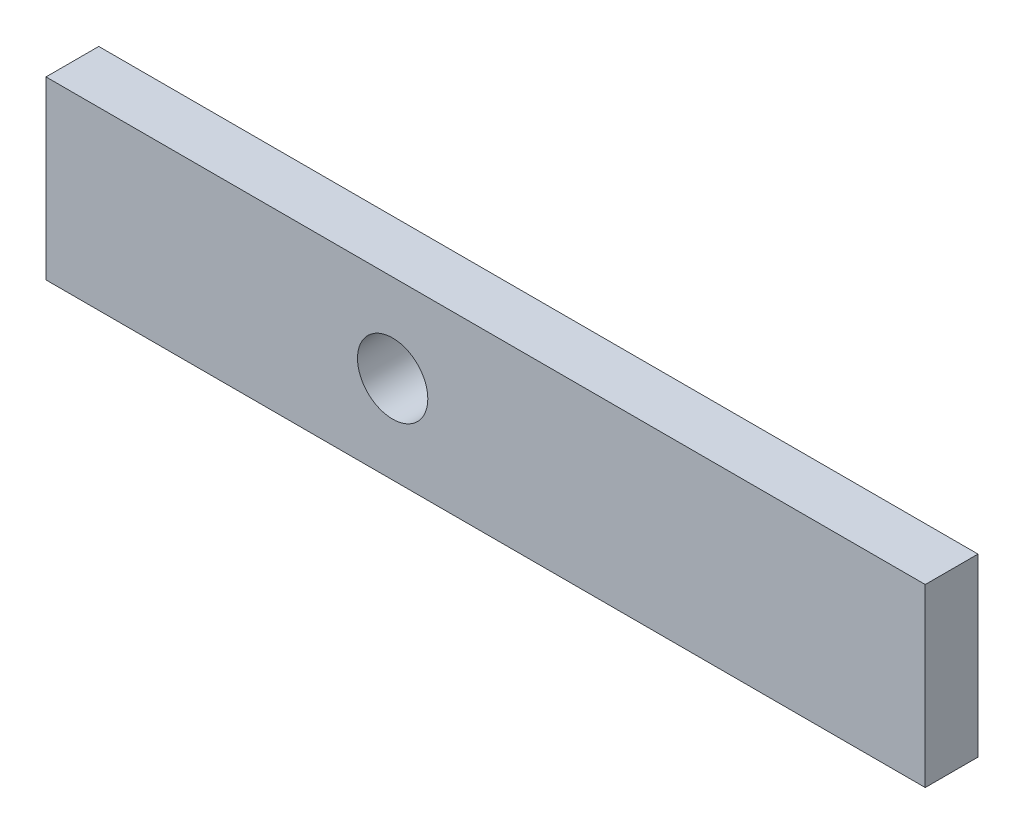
ISO-10303-21;
HEADER;
FILE_DESCRIPTION(('STEP AP214'),'2;1');
FILE_NAME('part.step','',(''),(''),'','','');
FILE_SCHEMA(('AUTOMOTIVE_DESIGN { 1 0 10303 214 1 1 1 1 }'));
ENDSEC;
DATA;
#1=APPLICATION_CONTEXT('core data for automotive mechanical design processes');
#2=APPLICATION_PROTOCOL_DEFINITION('international standard','automotive_design',2000,#1);
#3=PRODUCT_CONTEXT('',#1,'mechanical');
#4=PRODUCT('Part','Part','',(#3));
#5=PRODUCT_RELATED_PRODUCT_CATEGORY('part','',(#4));
#6=PRODUCT_DEFINITION_FORMATION('','',#4);
#7=PRODUCT_DEFINITION_CONTEXT('part definition',#1,'design');
#8=PRODUCT_DEFINITION('design','',#6,#7);
#9=PRODUCT_DEFINITION_SHAPE('','',#8);
#10=(LENGTH_UNIT() NAMED_UNIT(*) SI_UNIT(.MILLI.,.METRE.));
#11=(NAMED_UNIT(*) PLANE_ANGLE_UNIT() SI_UNIT($,.RADIAN.));
#12=(NAMED_UNIT(*) SI_UNIT($,.STERADIAN.) SOLID_ANGLE_UNIT());
#13=UNCERTAINTY_MEASURE_WITH_UNIT(LENGTH_MEASURE(1.E-05),#10,'distance_accuracy_value','');
#14=(GEOMETRIC_REPRESENTATION_CONTEXT(3) GLOBAL_UNCERTAINTY_ASSIGNED_CONTEXT((#13)) GLOBAL_UNIT_ASSIGNED_CONTEXT((#10,
#11,#12)) REPRESENTATION_CONTEXT('',''));
#15=CARTESIAN_POINT('',(0.,0.,0.));
#16=DIRECTION('',(0.,0.,1.));
#17=DIRECTION('',(1.,0.,0.));
#18=AXIS2_PLACEMENT_3D('',#15,#16,#17);
#19=CARTESIAN_POINT('',(0.,0.,6.));
#20=DIRECTION('',(1.,0.,0.));
#21=DIRECTION('',(0.,0.,-1.));
#22=AXIS2_PLACEMENT_3D('',#19,#20,#21);
#23=PLANE('',#22);
#24=DIRECTION('',(0.,-1.,0.));
#25=VECTOR('',#24,1.);
#26=CARTESIAN_POINT('',(0.,0.,0.));
#27=LINE('',#26,#25);
#28=CARTESIAN_POINT('',(0.,20.,0.));
#29=VERTEX_POINT('',#28);
#30=CARTESIAN_POINT('',(0.,0.,0.));
#31=VERTEX_POINT('',#30);
#32=EDGE_CURVE('E75',#29,#31,#27,.T.);
#33=ORIENTED_EDGE('',*,*,#32,.T.);
#34=DIRECTION('',(0.,0.,-1.));
#35=VECTOR('',#34,1.);
#36=CARTESIAN_POINT('',(0.,0.,6.));
#37=LINE('',#36,#35);
#38=CARTESIAN_POINT('',(0.,0.,6.));
#39=VERTEX_POINT('',#38);
#40=EDGE_CURVE('E11',#39,#31,#37,.T.);
#41=ORIENTED_EDGE('',*,*,#40,.F.);
#42=DIRECTION('',(0.,-1.,0.));
#43=VECTOR('',#42,1.);
#44=CARTESIAN_POINT('',(0.,0.,6.));
#45=LINE('',#44,#43);
#46=CARTESIAN_POINT('',(0.,20.,6.));
#47=VERTEX_POINT('',#46);
#48=EDGE_CURVE('E98',#47,#39,#45,.T.);
#49=ORIENTED_EDGE('',*,*,#48,.F.);
#50=DIRECTION('',(0.,0.,-1.));
#51=VECTOR('',#50,1.);
#52=CARTESIAN_POINT('',(0.,20.,6.));
#53=LINE('',#52,#51);
#54=EDGE_CURVE('E87',#47,#29,#53,.T.);
#55=ORIENTED_EDGE('',*,*,#54,.T.);
#56=EDGE_LOOP('',(#33,#41,#49,#55));
#57=FACE_BOUND('',#56,.T.);
#58=ADVANCED_FACE('F31',(#57),#23,.F.);
#59=CARTESIAN_POINT('',(0.,0.,6.));
#60=DIRECTION('',(0.,1.,0.));
#61=DIRECTION('',(0.,0.,1.));
#62=AXIS2_PLACEMENT_3D('',#59,#60,#61);
#63=PLANE('',#62);
#64=DIRECTION('',(1.,0.,0.));
#65=VECTOR('',#64,1.);
#66=CARTESIAN_POINT('',(0.,0.,0.));
#67=LINE('',#66,#65);
#68=CARTESIAN_POINT('',(100.,0.,0.));
#69=VERTEX_POINT('',#68);
#70=EDGE_CURVE('E71',#31,#69,#67,.T.);
#71=ORIENTED_EDGE('',*,*,#70,.T.);
#72=DIRECTION('',(0.,0.,-1.));
#73=VECTOR('',#72,1.);
#74=CARTESIAN_POINT('',(100.,0.,6.));
#75=LINE('',#74,#73);
#76=CARTESIAN_POINT('',(100.,0.,6.));
#77=VERTEX_POINT('',#76);
#78=EDGE_CURVE('E38',#77,#69,#75,.T.);
#79=ORIENTED_EDGE('',*,*,#78,.F.);
#80=DIRECTION('',(1.,0.,0.));
#81=VECTOR('',#80,1.);
#82=CARTESIAN_POINT('',(0.,0.,6.));
#83=LINE('',#82,#81);
#84=EDGE_CURVE('E83',#39,#77,#83,.T.);
#85=ORIENTED_EDGE('',*,*,#84,.F.);
#86=ORIENTED_EDGE('',*,*,#40,.T.);
#87=EDGE_LOOP('',(#71,#79,#85,#86));
#88=FACE_BOUND('',#87,.T.);
#89=ADVANCED_FACE('F82',(#88),#63,.F.);
#90=CARTESIAN_POINT('',(100.,0.,6.));
#91=DIRECTION('',(-1.,0.,0.));
#92=DIRECTION('',(0.,0.,1.));
#93=AXIS2_PLACEMENT_3D('',#90,#91,#92);
#94=PLANE('',#93);
#95=DIRECTION('',(0.,1.,0.));
#96=VECTOR('',#95,1.);
#97=CARTESIAN_POINT('',(100.,0.,0.));
#98=LINE('',#97,#96);
#99=CARTESIAN_POINT('',(100.,20.,0.));
#100=VERTEX_POINT('',#99);
#101=EDGE_CURVE('E76',#69,#100,#98,.T.);
#102=ORIENTED_EDGE('',*,*,#101,.T.);
#103=DIRECTION('',(0.,0.,-1.));
#104=VECTOR('',#103,1.);
#105=CARTESIAN_POINT('',(100.,20.,6.));
#106=LINE('',#105,#104);
#107=CARTESIAN_POINT('',(100.,20.,6.));
#108=VERTEX_POINT('',#107);
#109=EDGE_CURVE('E104',#108,#100,#106,.T.);
#110=ORIENTED_EDGE('',*,*,#109,.F.);
#111=DIRECTION('',(0.,1.,0.));
#112=VECTOR('',#111,1.);
#113=CARTESIAN_POINT('',(100.,0.,6.));
#114=LINE('',#113,#112);
#115=EDGE_CURVE('E50',#77,#108,#114,.T.);
#116=ORIENTED_EDGE('',*,*,#115,.F.);
#117=ORIENTED_EDGE('',*,*,#78,.T.);
#118=EDGE_LOOP('',(#102,#110,#116,#117));
#119=FACE_BOUND('',#118,.T.);
#120=ADVANCED_FACE('F107',(#119),#94,.F.);
#121=CARTESIAN_POINT('',(0.,20.,6.));
#122=DIRECTION('',(0.,-1.,0.));
#123=DIRECTION('',(0.,0.,-1.));
#124=AXIS2_PLACEMENT_3D('',#121,#122,#123);
#125=PLANE('',#124);
#126=DIRECTION('',(-1.,0.,0.));
#127=VECTOR('',#126,1.);
#128=CARTESIAN_POINT('',(0.,20.,0.));
#129=LINE('',#128,#127);
#130=EDGE_CURVE('E96',#100,#29,#129,.T.);
#131=ORIENTED_EDGE('',*,*,#130,.T.);
#132=ORIENTED_EDGE('',*,*,#54,.F.);
#133=DIRECTION('',(-1.,0.,0.));
#134=VECTOR('',#133,1.);
#135=CARTESIAN_POINT('',(0.,20.,6.));
#136=LINE('',#135,#134);
#137=EDGE_CURVE('E45',#108,#47,#136,.T.);
#138=ORIENTED_EDGE('',*,*,#137,.F.);
#139=ORIENTED_EDGE('',*,*,#109,.T.);
#140=EDGE_LOOP('',(#131,#132,#138,#139));
#141=FACE_BOUND('',#140,.T.);
#142=ADVANCED_FACE('F109',(#141),#125,.F.);
#143=CARTESIAN_POINT('',(0.,20.,6.));
#144=DIRECTION('',(0.,0.,-1.));
#145=DIRECTION('',(-1.,0.,0.));
#146=AXIS2_PLACEMENT_3D('',#143,#144,#145);
#147=PLANE('',#146);
#148=CARTESIAN_POINT('',(39.4262825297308,10.,6.));
#149=DIRECTION('',(0.,0.,1.));
#150=DIRECTION('',(1.,0.,0.));
#151=AXIS2_PLACEMENT_3D('',#148,#149,#150);
#152=CIRCLE('',#151,4.);
#153=CARTESIAN_POINT('',(43.4262825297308,10.,6.));
#154=VERTEX_POINT('',#153);
#155=EDGE_CURVE('E91',#154,#154,#152,.T.);
#156=ORIENTED_EDGE('',*,*,#155,.F.);
#157=EDGE_LOOP('',(#156));
#158=FACE_BOUND('',#157,.T.);
#159=ORIENTED_EDGE('',*,*,#48,.T.);
#160=ORIENTED_EDGE('',*,*,#84,.T.);
#161=ORIENTED_EDGE('',*,*,#115,.T.);
#162=ORIENTED_EDGE('',*,*,#137,.T.);
#163=EDGE_LOOP('',(#159,#160,#161,#162));
#164=FACE_BOUND('',#163,.T.);
#165=ADVANCED_FACE('F110',(#158,#164),#147,.F.);
#166=CARTESIAN_POINT('',(0.,20.,0.));
#167=DIRECTION('',(0.,0.,-1.));
#168=DIRECTION('',(-1.,0.,0.));
#169=AXIS2_PLACEMENT_3D('',#166,#167,#168);
#170=PLANE('',#169);
#171=CARTESIAN_POINT('',(39.4262825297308,10.,0.));
#172=DIRECTION('',(0.,0.,1.));
#173=DIRECTION('',(1.,0.,0.));
#174=AXIS2_PLACEMENT_3D('',#171,#172,#173);
#175=CIRCLE('',#174,4.);
#176=CARTESIAN_POINT('',(43.4262825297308,10.,0.));
#177=VERTEX_POINT('',#176);
#178=EDGE_CURVE('E88',#177,#177,#175,.T.);
#179=ORIENTED_EDGE('',*,*,#178,.T.);
#180=EDGE_LOOP('',(#179));
#181=FACE_BOUND('',#180,.T.);
#182=ORIENTED_EDGE('',*,*,#32,.F.);
#183=ORIENTED_EDGE('',*,*,#130,.F.);
#184=ORIENTED_EDGE('',*,*,#101,.F.);
#185=ORIENTED_EDGE('',*,*,#70,.F.);
#186=EDGE_LOOP('',(#182,#183,#184,#185));
#187=FACE_BOUND('',#186,.T.);
#188=ADVANCED_FACE('F72',(#181,#187),#170,.T.);
#189=CARTESIAN_POINT('',(39.4262825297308,10.,0.));
#190=DIRECTION('',(0.,0.,1.));
#191=DIRECTION('',(1.,0.,0.));
#192=AXIS2_PLACEMENT_3D('',#189,#190,#191);
#193=CYLINDRICAL_SURFACE('',#192,4.);
#194=ORIENTED_EDGE('',*,*,#178,.F.);
#195=EDGE_LOOP('',(#194));
#196=FACE_BOUND('',#195,.T.);
#197=ORIENTED_EDGE('',*,*,#155,.T.);
#198=EDGE_LOOP('',(#197));
#199=FACE_BOUND('',#198,.T.);
#200=ADVANCED_FACE('F118',(#196,#199),#193,.F.);
#201=CLOSED_SHELL('',(#58,#89,#120,#142,#165,#188,#200));
#202=MANIFOLD_SOLID_BREP('B2',#201);
#203=ADVANCED_BREP_SHAPE_REPRESENTATION('',(#18,#202),#14);
#204=SHAPE_DEFINITION_REPRESENTATION(#9,#203);
ENDSEC;
END-ISO-10303-21;
